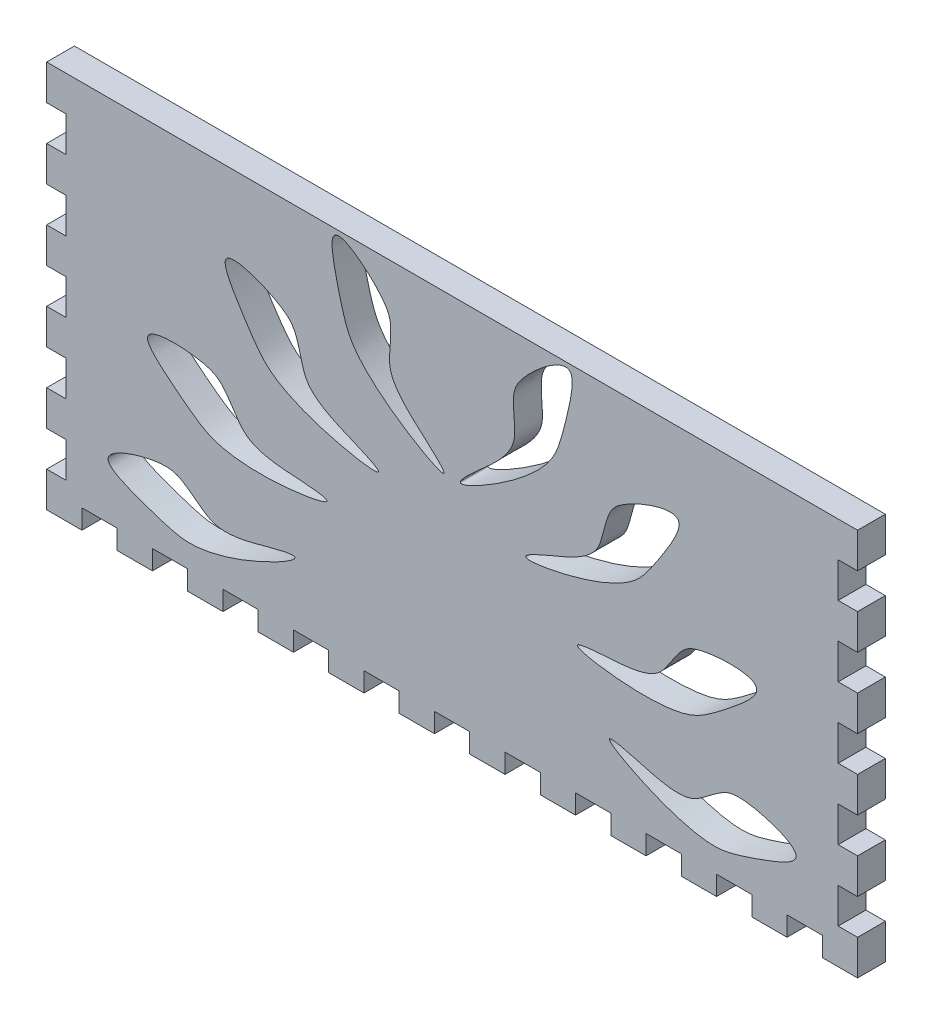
from build123d import *

# Parameters (mm, degrees)
BOSS_EXTRUDE1_DEPTH  = 3.999992
CUT_EXTRUDE1_DEPTH   = 65.88096744
CIRPATTERN2_COUNT    = 4
CIRPATTERN2_ANGLE    = 57
MIRROR3_COPY_1_DEPTH = 65.88096744
MIRROR3_COPY_2_DEPTH = 65.88096744
MIRROR3_COPY_3_DEPTH = 65.88096744


with BuildPart() as part:
    # Sketch1 → Boss-Extrude1 (new body)
    with BuildSketch(Plane.XY):
        Polygon((-53.34, -27.94), (-53.34, -25.146), (-48.26, -25.146), (-48.26, -27.94), (-43.18, -27.94), (-43.18, -25.146), (-38.1, -25.146), (-38.1, -27.94), (-33.02, -27.94), (-33.02, -25.146), (-27.94, -25.146), (-27.94, -27.94), (-22.86, -27.94), (-22.86, -25.146), (-17.78, -25.146), (-17.78, -27.94), (-12.7, -27.94), (-12.7, -25.146), (-7.62, -25.146), (-7.62, -27.94), (-2.54, -27.94), (-2.54, -25.146), (2.54, -25.146), (2.54, -27.94), (7.62, -27.94), (7.62, -25.146), (12.7, -25.146), (12.7, -27.94), (17.78, -27.94), (17.78, -25.146), (22.86, -25.146), (22.86, -27.94), (27.94, -27.94), (27.94, -25.146), (33.02, -25.146), (33.02, -27.94), (38.1, -27.94), (38.1, -25.146), (43.18, -25.146), (43.18, -27.94), (48.26, -27.94), (48.26, -25.146), (53.34, -25.146), (53.34, -27.94), (58.42, -27.94), (58.42, -22.86), (55.626, -22.86), (55.626, -17.78), (58.42, -17.78), (58.42, -12.7), (55.626, -12.7), (55.626, -7.62), (58.42, -7.62), (58.42, -2.54), (55.626, -2.54), (55.626, 2.54), (58.42, 2.54), (58.42, 7.62), (55.626, 7.62), (55.626, 12.7), (58.42, 12.7), (58.42, 17.78), (55.626, 17.78), (55.626, 22.86), (58.42, 22.86), (58.42, 27.94), (-58.42, 27.94), (-58.42, 22.86), (-55.626, 22.86), (-55.626, 17.78), (-58.42, 17.78), (-58.42, 12.7), (-55.626, 12.7), (-55.626, 7.62), (-58.42, 7.62), (-58.42, 2.54), (-55.626, 2.54), (-55.626, -2.54), (-58.42, -2.54), (-58.42, -7.62), (-55.626, -7.62), (-55.626, -12.7), (-58.42, -12.7), (-58.42, -17.78), (-55.626, -17.78), (-55.626, -22.86), (-58.42, -22.86), (-58.42, -27.94), align=None)
    extrude(amount=BOSS_EXTRUDE1_DEPTH)

    # Sketch2 → Cut-Extrude1 (cut, through all)
    with BuildSketch(Plane.XY.offset(3.999992)):
        with BuildLine():
            add(Edge.make_bspline(
                [(26.554684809, -16.627459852), (29.083973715, -17.314141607), (33.313062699, -18.631000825), (38.754244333, -14.608435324), (40.620154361, -12.888052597), (53.165519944, -16.796317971), (45.151127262, -19.93426118), (40.00569192, -21.655039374), (37.097497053, -22.209898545), (27.987361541, -19.562989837), (19.60357176, -14.989020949), (24.733507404, -16.133024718), (26.554684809, -16.627459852)],
                knots=[0, 0, 0, 0, 0.085893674, 0.109581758, 0.236880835, 0.405004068, 0.508251, 0.586835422, 0.740472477, 0.775604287, 0.938153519, 1, 1, 1, 1], degree=3))
        make_face()
    cut_extrude1 = extrude(amount=-CUT_EXTRUDE1_DEPTH, mode=Mode.SUBTRACT)

    # CirPattern2: Cut-Extrude1 ×4 about axis
    cirpattern2_axis = Axis((-7.62, -25.146, 3.999992), (0, 0, 1))
    for i in range(1, CIRPATTERN2_COUNT):
        add(cut_extrude1.rotate(cirpattern2_axis, i * CIRPATTERN2_ANGLE / (CIRPATTERN2_COUNT - 1)), mode=Mode.SUBTRACT)

    # Mirror3: Cut-Extrude1 across plane
    add(cut_extrude1.mirror(Plane(origin=(0, 0, 0), x_dir=(0, 0, 1), z_dir=(1, 0, 0))), mode=Mode.SUBTRACT)

    # Mirror3 copy 1 sketch → Mirror3 copy 1 (cut, through all)
    with BuildSketch(Plane(origin=(8.601885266, 1.110839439, 3.999992), x_dir=(-0.9455185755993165, 0.32556815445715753, 0), z_dir=(0, 0, 1))):
        with BuildLine():
            add(Edge.make_bspline(
                [(26.554684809, 16.627459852), (29.083973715, 17.314141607), (33.313062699, 18.631000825), (38.754244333, 14.608435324), (40.620154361, 12.888052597), (53.165519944, 16.796317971), (45.151127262, 19.93426118), (40.00569192, 21.655039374), (37.097497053, 22.209898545), (27.987361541, 19.562989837), (19.60357176, 14.989020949), (24.733507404, 16.133024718), (26.554684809, 16.627459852)],
                knots=[0, 0, 0, 0, 0.085893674, 0.109581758, 0.236880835, 0.405004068, 0.508251, 0.586835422, 0.740472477, 0.775604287, 0.938153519, 1, 1, 1, 1], degree=3))
        make_face()
    extrude(amount=-MIRROR3_COPY_1_DEPTH, mode=Mode.SUBTRACT)

    # Mirror3 copy 2 sketch → Mirror3 copy 2 (cut, through all)
    with BuildSketch(Plane(origin=(17.096781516, -0.639341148, 3.999992), x_dir=(-0.7880107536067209, 0.6156614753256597, 0), z_dir=(0, 0, 1))):
        with BuildLine():
            add(Edge.make_bspline(
                [(26.554684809, 16.627459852), (29.083973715, 17.314141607), (33.313062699, 18.631000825), (38.754244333, 14.608435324), (40.620154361, 12.888052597), (53.165519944, 16.796317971), (45.151127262, 19.93426118), (40.00569192, 21.655039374), (37.097497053, 22.209898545), (27.987361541, 19.562989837), (19.60357176, 14.989020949), (24.733507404, 16.133024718), (26.554684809, 16.627459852)],
                knots=[0, 0, 0, 0, 0.085893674, 0.109581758, 0.236880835, 0.405004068, 0.508251, 0.586835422, 0.740472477, 0.775604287, 0.938153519, 1, 1, 1, 1], degree=3))
        make_face()
    extrude(amount=-MIRROR3_COPY_2_DEPTH, mode=Mode.SUBTRACT)

    # Mirror3 copy 3 sketch → Mirror3 copy 3 (cut, through all)
    with BuildSketch(Plane(origin=(24.559060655, -5.059837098, 3.999992), x_dir=(-0.5446390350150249, 0.8386705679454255, 0), z_dir=(0, 0, 1))):
        with BuildLine():
            add(Edge.make_bspline(
                [(26.554684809, 16.627459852), (29.083973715, 17.314141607), (33.313062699, 18.631000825), (38.754244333, 14.608435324), (40.620154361, 12.888052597), (53.165519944, 16.796317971), (45.151127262, 19.93426118), (40.00569192, 21.655039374), (37.097497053, 22.209898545), (27.987361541, 19.562989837), (19.60357176, 14.989020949), (24.733507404, 16.133024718), (26.554684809, 16.627459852)],
                knots=[0, 0, 0, 0, 0.085893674, 0.109581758, 0.236880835, 0.405004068, 0.508251, 0.586835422, 0.740472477, 0.775604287, 0.938153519, 1, 1, 1, 1], degree=3))
        make_face()
    extrude(amount=-MIRROR3_COPY_3_DEPTH, mode=Mode.SUBTRACT)


solid = part.part
